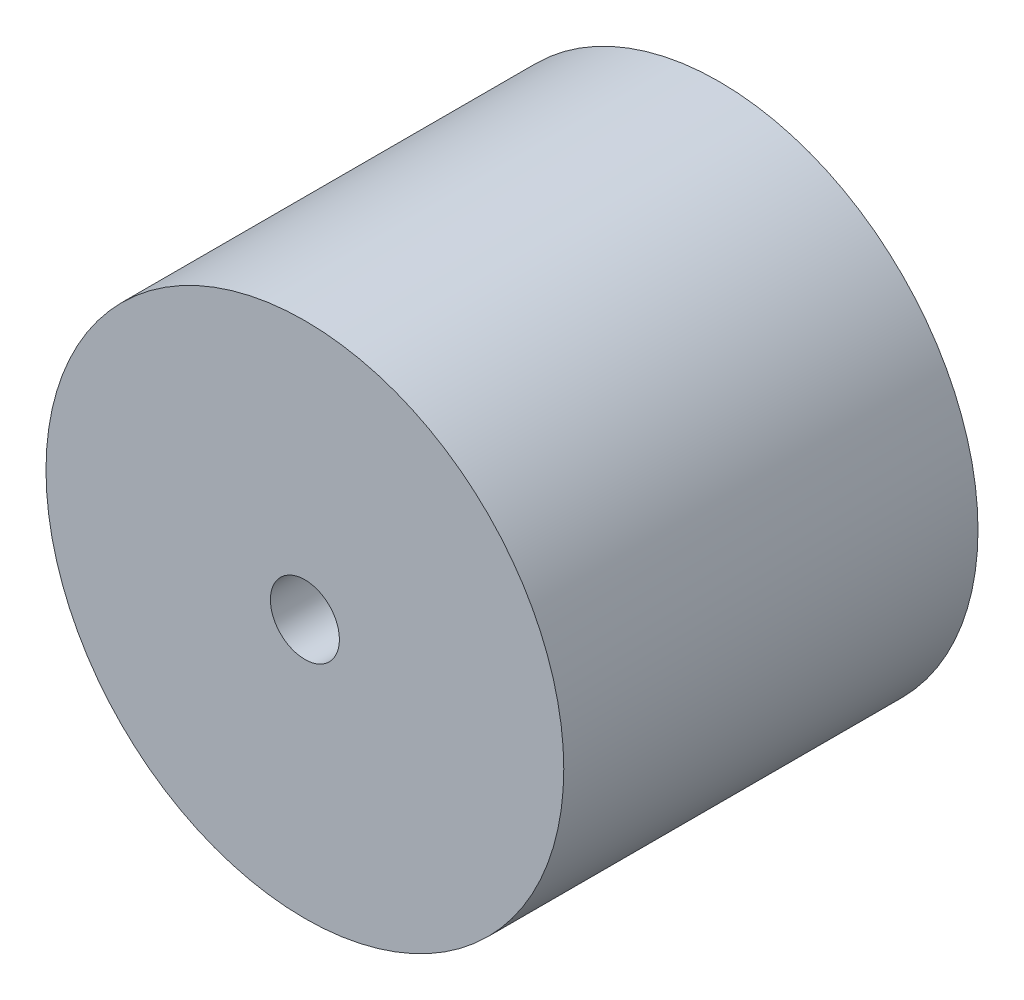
ISO-10303-21;
HEADER;
FILE_DESCRIPTION(('STEP AP214'),'2;1');
FILE_NAME('part.step','',(''),(''),'','','');
FILE_SCHEMA(('AUTOMOTIVE_DESIGN { 1 0 10303 214 1 1 1 1 }'));
ENDSEC;
DATA;
#1=APPLICATION_CONTEXT('core data for automotive mechanical design processes');
#2=APPLICATION_PROTOCOL_DEFINITION('international standard','automotive_design',2000,#1);
#3=PRODUCT_CONTEXT('',#1,'mechanical');
#4=PRODUCT('Part','Part','',(#3));
#5=PRODUCT_RELATED_PRODUCT_CATEGORY('part','',(#4));
#6=PRODUCT_DEFINITION_FORMATION('','',#4);
#7=PRODUCT_DEFINITION_CONTEXT('part definition',#1,'design');
#8=PRODUCT_DEFINITION('design','',#6,#7);
#9=PRODUCT_DEFINITION_SHAPE('','',#8);
#10=(LENGTH_UNIT() NAMED_UNIT(*) SI_UNIT(.MILLI.,.METRE.));
#11=(NAMED_UNIT(*) PLANE_ANGLE_UNIT() SI_UNIT($,.RADIAN.));
#12=(NAMED_UNIT(*) SI_UNIT($,.STERADIAN.) SOLID_ANGLE_UNIT());
#13=UNCERTAINTY_MEASURE_WITH_UNIT(LENGTH_MEASURE(1.E-05),#10,'distance_accuracy_value','');
#14=(GEOMETRIC_REPRESENTATION_CONTEXT(3) GLOBAL_UNCERTAINTY_ASSIGNED_CONTEXT((#13)) GLOBAL_UNIT_ASSIGNED_CONTEXT((#10,
#11,#12)) REPRESENTATION_CONTEXT('',''));
#15=CARTESIAN_POINT('',(0.,0.,0.));
#16=DIRECTION('',(0.,0.,1.));
#17=DIRECTION('',(1.,0.,0.));
#18=AXIS2_PLACEMENT_3D('',#15,#16,#17);
#19=CARTESIAN_POINT('',(0.,0.,12.));
#20=DIRECTION('',(0.,0.,1.));
#21=DIRECTION('',(1.,0.,0.));
#22=AXIS2_PLACEMENT_3D('',#19,#20,#21);
#23=PLANE('',#22);
#24=CARTESIAN_POINT('',(0.,0.,12.));
#25=DIRECTION('',(0.,0.,1.));
#26=DIRECTION('',(1.,0.,0.));
#27=AXIS2_PLACEMENT_3D('',#24,#25,#26);
#28=CIRCLE('',#27,7.5);
#29=CARTESIAN_POINT('',(7.5,0.,12.));
#30=VERTEX_POINT('',#29);
#31=EDGE_CURVE('E11',#30,#30,#28,.T.);
#32=ORIENTED_EDGE('',*,*,#31,.T.);
#33=EDGE_LOOP('',(#32));
#34=FACE_BOUND('',#33,.T.);
#35=CARTESIAN_POINT('',(0.,0.,12.));
#36=DIRECTION('',(0.,0.,1.));
#37=DIRECTION('',(1.,0.,0.));
#38=AXIS2_PLACEMENT_3D('',#35,#36,#37);
#39=CIRCLE('',#38,1.);
#40=CARTESIAN_POINT('',(1.,0.,12.));
#41=VERTEX_POINT('',#40);
#42=EDGE_CURVE('E48',#41,#41,#39,.T.);
#43=ORIENTED_EDGE('',*,*,#42,.F.);
#44=EDGE_LOOP('',(#43));
#45=FACE_BOUND('',#44,.T.);
#46=ADVANCED_FACE('F37',(#34,#45),#23,.T.);
#47=CARTESIAN_POINT('',(0.,0.,0.));
#48=DIRECTION('',(0.,0.,1.));
#49=DIRECTION('',(1.,0.,0.));
#50=AXIS2_PLACEMENT_3D('',#47,#48,#49);
#51=PLANE('',#50);
#52=CARTESIAN_POINT('',(0.,0.,0.));
#53=DIRECTION('',(0.,0.,1.));
#54=DIRECTION('',(1.,0.,0.));
#55=AXIS2_PLACEMENT_3D('',#52,#53,#54);
#56=CIRCLE('',#55,7.5);
#57=CARTESIAN_POINT('',(7.5,0.,0.));
#58=VERTEX_POINT('',#57);
#59=EDGE_CURVE('E41',#58,#58,#56,.T.);
#60=ORIENTED_EDGE('',*,*,#59,.F.);
#61=EDGE_LOOP('',(#60));
#62=FACE_BOUND('',#61,.T.);
#63=CARTESIAN_POINT('',(0.,0.,0.));
#64=DIRECTION('',(0.,0.,1.));
#65=DIRECTION('',(1.,0.,0.));
#66=AXIS2_PLACEMENT_3D('',#63,#64,#65);
#67=CIRCLE('',#66,1.);
#68=CARTESIAN_POINT('',(1.,0.,0.));
#69=VERTEX_POINT('',#68);
#70=EDGE_CURVE('E50',#69,#69,#67,.T.);
#71=ORIENTED_EDGE('',*,*,#70,.T.);
#72=EDGE_LOOP('',(#71));
#73=FACE_BOUND('',#72,.T.);
#74=ADVANCED_FACE('F60',(#62,#73),#51,.F.);
#75=CARTESIAN_POINT('',(0.,0.,12.));
#76=DIRECTION('',(0.,0.,-1.));
#77=DIRECTION('',(-1.,0.,0.));
#78=AXIS2_PLACEMENT_3D('',#75,#76,#77);
#79=CYLINDRICAL_SURFACE('',#78,7.5);
#80=ORIENTED_EDGE('',*,*,#31,.F.);
#81=EDGE_LOOP('',(#80));
#82=FACE_BOUND('',#81,.T.);
#83=ORIENTED_EDGE('',*,*,#59,.T.);
#84=EDGE_LOOP('',(#83));
#85=FACE_BOUND('',#84,.T.);
#86=ADVANCED_FACE('F39',(#82,#85),#79,.T.);
#87=CARTESIAN_POINT('',(0.,0.,12.));
#88=DIRECTION('',(0.,0.,-1.));
#89=DIRECTION('',(-1.,0.,0.));
#90=AXIS2_PLACEMENT_3D('',#87,#88,#89);
#91=CYLINDRICAL_SURFACE('',#90,1.);
#92=ORIENTED_EDGE('',*,*,#42,.T.);
#93=EDGE_LOOP('',(#92));
#94=FACE_BOUND('',#93,.T.);
#95=ORIENTED_EDGE('',*,*,#70,.F.);
#96=EDGE_LOOP('',(#95));
#97=FACE_BOUND('',#96,.T.);
#98=ADVANCED_FACE('F56',(#94,#97),#91,.F.);
#99=CLOSED_SHELL('',(#46,#74,#86,#98));
#100=MANIFOLD_SOLID_BREP('B2',#99);
#101=ADVANCED_BREP_SHAPE_REPRESENTATION('',(#18,#100),#14);
#102=SHAPE_DEFINITION_REPRESENTATION(#9,#101);
ENDSEC;
END-ISO-10303-21;
